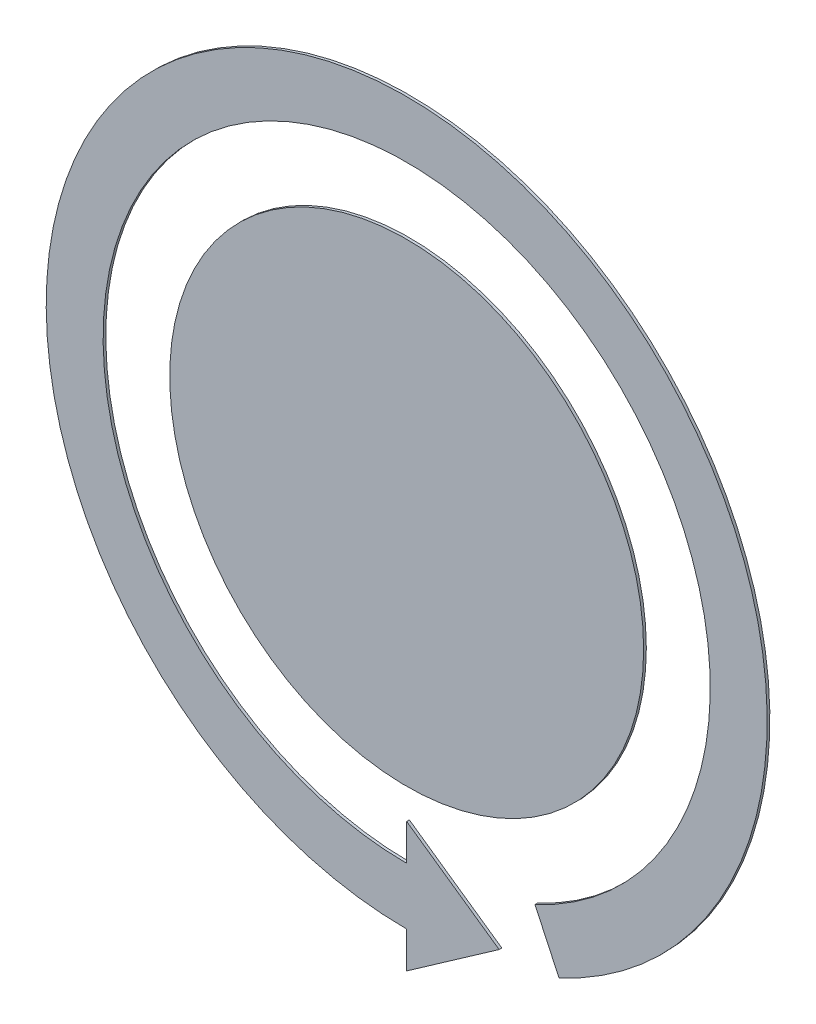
ISO-10303-21;
HEADER;
FILE_DESCRIPTION(('STEP AP214'),'2;1');
FILE_NAME('part.step','',(''),(''),'','','');
FILE_SCHEMA(('AUTOMOTIVE_DESIGN { 1 0 10303 214 1 1 1 1 }'));
ENDSEC;
DATA;
#1=APPLICATION_CONTEXT('core data for automotive mechanical design processes');
#2=APPLICATION_PROTOCOL_DEFINITION('international standard','automotive_design',2000,#1);
#3=PRODUCT_CONTEXT('',#1,'mechanical');
#4=PRODUCT('Part','Part','',(#3));
#5=PRODUCT_RELATED_PRODUCT_CATEGORY('part','',(#4));
#6=PRODUCT_DEFINITION_FORMATION('','',#4);
#7=PRODUCT_DEFINITION_CONTEXT('part definition',#1,'design');
#8=PRODUCT_DEFINITION('design','',#6,#7);
#9=PRODUCT_DEFINITION_SHAPE('','',#8);
#10=(LENGTH_UNIT() NAMED_UNIT(*) SI_UNIT(.MILLI.,.METRE.));
#11=(NAMED_UNIT(*) PLANE_ANGLE_UNIT() SI_UNIT($,.RADIAN.));
#12=(NAMED_UNIT(*) SI_UNIT($,.STERADIAN.) SOLID_ANGLE_UNIT());
#13=UNCERTAINTY_MEASURE_WITH_UNIT(LENGTH_MEASURE(1.E-05),#10,'distance_accuracy_value','');
#14=(GEOMETRIC_REPRESENTATION_CONTEXT(3) GLOBAL_UNCERTAINTY_ASSIGNED_CONTEXT((#13)) GLOBAL_UNIT_ASSIGNED_CONTEXT((#10,
#11,#12)) REPRESENTATION_CONTEXT('',''));
#15=CARTESIAN_POINT('',(0.,0.,0.));
#16=DIRECTION('',(0.,0.,1.));
#17=DIRECTION('',(1.,0.,0.));
#18=AXIS2_PLACEMENT_3D('',#15,#16,#17);
#19=CARTESIAN_POINT('',(0.,0.,3.));
#20=DIRECTION('',(0.,0.,-1.));
#21=DIRECTION('',(-1.,0.,0.));
#22=AXIS2_PLACEMENT_3D('',#19,#20,#21);
#23=CYLINDRICAL_SURFACE('',#22,402.162503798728);
#24=CARTESIAN_POINT('',(0.,0.,0.));
#25=DIRECTION('',(0.,0.,1.));
#26=DIRECTION('',(1.,0.,0.));
#27=AXIS2_PLACEMENT_3D('',#24,#25,#26);
#28=CIRCLE('',#27,402.162503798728);
#29=CARTESIAN_POINT('',(169.961218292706,-364.483008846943,0.));
#30=VERTEX_POINT('',#29);
#31=CARTESIAN_POINT('',(0.,-402.162503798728,0.));
#32=VERTEX_POINT('',#31);
#33=EDGE_CURVE('E133',#30,#32,#28,.T.);
#34=ORIENTED_EDGE('',*,*,#33,.T.);
#35=DIRECTION('',(0.,0.,-1.));
#36=VECTOR('',#35,1.);
#37=CARTESIAN_POINT('',(0.,-402.162503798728,3.));
#38=LINE('',#37,#36);
#39=CARTESIAN_POINT('',(0.,-402.162503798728,3.));
#40=VERTEX_POINT('',#39);
#41=EDGE_CURVE('E12',#40,#32,#38,.T.);
#42=ORIENTED_EDGE('',*,*,#41,.F.);
#43=CARTESIAN_POINT('',(0.,0.,3.));
#44=DIRECTION('',(0.,0.,1.));
#45=DIRECTION('',(1.,0.,0.));
#46=AXIS2_PLACEMENT_3D('',#43,#44,#45);
#47=CIRCLE('',#46,402.162503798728);
#48=CARTESIAN_POINT('',(169.961218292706,-364.483008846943,3.));
#49=VERTEX_POINT('',#48);
#50=EDGE_CURVE('E145',#49,#40,#47,.T.);
#51=ORIENTED_EDGE('',*,*,#50,.F.);
#52=DIRECTION('',(0.,0.,-1.));
#53=VECTOR('',#52,1.);
#54=CARTESIAN_POINT('',(169.961218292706,-364.483008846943,3.));
#55=LINE('',#54,#53);
#56=EDGE_CURVE('E129',#49,#30,#55,.T.);
#57=ORIENTED_EDGE('',*,*,#56,.T.);
#58=EDGE_LOOP('',(#34,#42,#51,#57));
#59=FACE_BOUND('',#58,.T.);
#60=ADVANCED_FACE('F43',(#59),#23,.T.);
#61=CARTESIAN_POINT('',(0.,-442.630507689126,3.));
#62=DIRECTION('',(1.,0.,0.));
#63=DIRECTION('',(0.,0.,-1.));
#64=AXIS2_PLACEMENT_3D('',#61,#62,#63);
#65=PLANE('',#64);
#66=DIRECTION('',(0.,-1.,0.));
#67=VECTOR('',#66,1.);
#68=CARTESIAN_POINT('',(0.,-442.630507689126,0.));
#69=LINE('',#68,#67);
#70=CARTESIAN_POINT('',(0.,-442.630507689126,0.));
#71=VERTEX_POINT('',#70);
#72=EDGE_CURVE('E136',#32,#71,#69,.T.);
#73=ORIENTED_EDGE('',*,*,#72,.T.);
#74=DIRECTION('',(0.,0.,-1.));
#75=VECTOR('',#74,1.);
#76=CARTESIAN_POINT('',(0.,-442.630507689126,3.));
#77=LINE('',#76,#75);
#78=CARTESIAN_POINT('',(0.,-442.630507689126,3.));
#79=VERTEX_POINT('',#78);
#80=EDGE_CURVE('E51',#79,#71,#77,.T.);
#81=ORIENTED_EDGE('',*,*,#80,.F.);
#82=DIRECTION('',(0.,-1.,0.));
#83=VECTOR('',#82,1.);
#84=CARTESIAN_POINT('',(0.,-442.630507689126,3.));
#85=LINE('',#84,#83);
#86=EDGE_CURVE('E99',#40,#79,#85,.T.);
#87=ORIENTED_EDGE('',*,*,#86,.F.);
#88=ORIENTED_EDGE('',*,*,#41,.T.);
#89=EDGE_LOOP('',(#73,#81,#87,#88));
#90=FACE_BOUND('',#89,.T.);
#91=ADVANCED_FACE('F170',(#90),#65,.F.);
#92=CARTESIAN_POINT('',(103.132265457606,-370.416663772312,3.));
#93=DIRECTION('',(-0.573575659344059,0.819152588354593,0.));
#94=DIRECTION('',(-0.819152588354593,-0.573575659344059,0.));
#95=AXIS2_PLACEMENT_3D('',#92,#93,#94);
#96=PLANE('',#95);
#97=DIRECTION('',(0.819152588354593,0.573575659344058,0.));
#98=VECTOR('',#97,1.);
#99=CARTESIAN_POINT('',(103.132265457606,-370.416663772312,0.));
#100=LINE('',#99,#98);
#101=CARTESIAN_POINT('',(103.132265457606,-370.416663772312,0.));
#102=VERTEX_POINT('',#101);
#103=EDGE_CURVE('E138',#71,#102,#100,.T.);
#104=ORIENTED_EDGE('',*,*,#103,.T.);
#105=DIRECTION('',(0.,0.,-1.));
#106=VECTOR('',#105,1.);
#107=CARTESIAN_POINT('',(103.132265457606,-370.416663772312,3.));
#108=LINE('',#107,#106);
#109=CARTESIAN_POINT('',(103.132265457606,-370.416663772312,3.));
#110=VERTEX_POINT('',#109);
#111=EDGE_CURVE('E149',#110,#102,#108,.T.);
#112=ORIENTED_EDGE('',*,*,#111,.F.);
#113=DIRECTION('',(0.819152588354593,0.573575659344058,0.));
#114=VECTOR('',#113,1.);
#115=CARTESIAN_POINT('',(103.132265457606,-370.416663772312,3.));
#116=LINE('',#115,#114);
#117=EDGE_CURVE('E157',#79,#110,#116,.T.);
#118=ORIENTED_EDGE('',*,*,#117,.F.);
#119=ORIENTED_EDGE('',*,*,#80,.T.);
#120=EDGE_LOOP('',(#104,#112,#118,#119));
#121=FACE_BOUND('',#120,.T.);
#122=ADVANCED_FACE('F155',(#121),#96,.F.);
#123=CARTESIAN_POINT('',(0.,-298.202571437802,3.));
#124=DIRECTION('',(-0.573576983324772,-0.819151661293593,0.));
#125=DIRECTION('',(0.819151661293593,-0.573576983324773,0.));
#126=AXIS2_PLACEMENT_3D('',#123,#124,#125);
#127=PLANE('',#126);
#128=DIRECTION('',(-0.819151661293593,0.573576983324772,0.));
#129=VECTOR('',#128,1.);
#130=CARTESIAN_POINT('',(0.,-298.202571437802,0.));
#131=LINE('',#130,#129);
#132=CARTESIAN_POINT('',(0.,-298.202571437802,0.));
#133=VERTEX_POINT('',#132);
#134=EDGE_CURVE('E140',#102,#133,#131,.T.);
#135=ORIENTED_EDGE('',*,*,#134,.T.);
#136=DIRECTION('',(0.,0.,-1.));
#137=VECTOR('',#136,1.);
#138=CARTESIAN_POINT('',(0.,-298.202571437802,3.));
#139=LINE('',#138,#137);
#140=CARTESIAN_POINT('',(0.,-298.202571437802,3.));
#141=VERTEX_POINT('',#140);
#142=EDGE_CURVE('E124',#141,#133,#139,.T.);
#143=ORIENTED_EDGE('',*,*,#142,.F.);
#144=DIRECTION('',(-0.819151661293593,0.573576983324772,0.));
#145=VECTOR('',#144,1.);
#146=CARTESIAN_POINT('',(0.,-298.202571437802,3.));
#147=LINE('',#146,#145);
#148=EDGE_CURVE('E115',#110,#141,#147,.T.);
#149=ORIENTED_EDGE('',*,*,#148,.F.);
#150=ORIENTED_EDGE('',*,*,#111,.T.);
#151=EDGE_LOOP('',(#135,#143,#149,#150));
#152=FACE_BOUND('',#151,.T.);
#153=ADVANCED_FACE('F163',(#152),#127,.F.);
#154=CARTESIAN_POINT('',(0.,-338.6705753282,3.));
#155=DIRECTION('',(1.,0.,0.));
#156=DIRECTION('',(0.,0.,-1.));
#157=AXIS2_PLACEMENT_3D('',#154,#155,#156);
#158=PLANE('',#157);
#159=DIRECTION('',(0.,-1.,0.));
#160=VECTOR('',#159,1.);
#161=CARTESIAN_POINT('',(0.,-338.6705753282,0.));
#162=LINE('',#161,#160);
#163=CARTESIAN_POINT('',(0.,-338.6705753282,0.));
#164=VERTEX_POINT('',#163);
#165=EDGE_CURVE('E123',#133,#164,#162,.T.);
#166=ORIENTED_EDGE('',*,*,#165,.T.);
#167=DIRECTION('',(0.,0.,-1.));
#168=VECTOR('',#167,1.);
#169=CARTESIAN_POINT('',(0.,-338.6705753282,3.));
#170=LINE('',#169,#168);
#171=CARTESIAN_POINT('',(0.,-338.6705753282,3.));
#172=VERTEX_POINT('',#171);
#173=EDGE_CURVE('E120',#172,#164,#170,.T.);
#174=ORIENTED_EDGE('',*,*,#173,.F.);
#175=DIRECTION('',(0.,-1.,0.));
#176=VECTOR('',#175,1.);
#177=CARTESIAN_POINT('',(0.,-338.6705753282,3.));
#178=LINE('',#177,#176);
#179=EDGE_CURVE('E109',#141,#172,#178,.T.);
#180=ORIENTED_EDGE('',*,*,#179,.F.);
#181=ORIENTED_EDGE('',*,*,#142,.T.);
#182=EDGE_LOOP('',(#166,#174,#180,#181));
#183=FACE_BOUND('',#182,.T.);
#184=ADVANCED_FACE('F121',(#183),#158,.F.);
#185=CARTESIAN_POINT('',(0.,0.,3.));
#186=DIRECTION('',(0.,0.,-1.));
#187=DIRECTION('',(-1.,0.,0.));
#188=AXIS2_PLACEMENT_3D('',#185,#186,#187);
#189=CYLINDRICAL_SURFACE('',#188,338.6705753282);
#190=CARTESIAN_POINT('',(0.,0.,0.));
#191=DIRECTION('',(0.,0.,-1.));
#192=DIRECTION('',(1.,0.,0.));
#193=AXIS2_PLACEMENT_3D('',#190,#191,#192);
#194=CIRCLE('',#193,338.6705753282);
#195=CARTESIAN_POINT('',(143.128369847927,-306.93977966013,0.));
#196=VERTEX_POINT('',#195);
#197=EDGE_CURVE('E85',#164,#196,#194,.T.);
#198=ORIENTED_EDGE('',*,*,#197,.T.);
#199=DIRECTION('',(0.,0.,-1.));
#200=VECTOR('',#199,1.);
#201=CARTESIAN_POINT('',(143.128369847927,-306.93977966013,3.));
#202=LINE('',#201,#200);
#203=CARTESIAN_POINT('',(143.128369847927,-306.93977966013,3.));
#204=VERTEX_POINT('',#203);
#205=EDGE_CURVE('E125',#204,#196,#202,.T.);
#206=ORIENTED_EDGE('',*,*,#205,.F.);
#207=CARTESIAN_POINT('',(0.,0.,3.));
#208=DIRECTION('',(0.,0.,-1.));
#209=DIRECTION('',(1.,0.,0.));
#210=AXIS2_PLACEMENT_3D('',#207,#208,#209);
#211=CIRCLE('',#210,338.6705753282);
#212=EDGE_CURVE('E113',#172,#204,#211,.T.);
#213=ORIENTED_EDGE('',*,*,#212,.F.);
#214=ORIENTED_EDGE('',*,*,#173,.T.);
#215=EDGE_LOOP('',(#198,#206,#213,#214));
#216=FACE_BOUND('',#215,.T.);
#217=ADVANCED_FACE('F127',(#216),#189,.F.);
#218=CARTESIAN_POINT('',(169.961218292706,-364.483008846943,3.));
#219=DIRECTION('',(0.906307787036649,0.422618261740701,0.));
#220=DIRECTION('',(-0.422618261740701,0.906307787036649,0.));
#221=AXIS2_PLACEMENT_3D('',#218,#219,#220);
#222=PLANE('',#221);
#223=DIRECTION('',(0.422618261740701,-0.906307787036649,0.));
#224=VECTOR('',#223,1.);
#225=CARTESIAN_POINT('',(169.961218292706,-364.483008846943,0.));
#226=LINE('',#225,#224);
#227=EDGE_CURVE('E91',#196,#30,#226,.T.);
#228=ORIENTED_EDGE('',*,*,#227,.T.);
#229=ORIENTED_EDGE('',*,*,#56,.F.);
#230=DIRECTION('',(0.422618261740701,-0.906307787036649,0.));
#231=VECTOR('',#230,1.);
#232=CARTESIAN_POINT('',(169.961218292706,-364.483008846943,3.));
#233=LINE('',#232,#231);
#234=EDGE_CURVE('E59',#204,#49,#233,.T.);
#235=ORIENTED_EDGE('',*,*,#234,.F.);
#236=ORIENTED_EDGE('',*,*,#205,.T.);
#237=EDGE_LOOP('',(#228,#229,#235,#236));
#238=FACE_BOUND('',#237,.T.);
#239=ADVANCED_FACE('F184',(#238),#222,.F.);
#240=CARTESIAN_POINT('',(0.,0.,3.));
#241=DIRECTION('',(0.,0.,1.));
#242=DIRECTION('',(1.,0.,0.));
#243=AXIS2_PLACEMENT_3D('',#240,#241,#242);
#244=PLANE('',#243);
#245=ORIENTED_EDGE('',*,*,#50,.T.);
#246=ORIENTED_EDGE('',*,*,#86,.T.);
#247=ORIENTED_EDGE('',*,*,#117,.T.);
#248=ORIENTED_EDGE('',*,*,#148,.T.);
#249=ORIENTED_EDGE('',*,*,#179,.T.);
#250=ORIENTED_EDGE('',*,*,#212,.T.);
#251=ORIENTED_EDGE('',*,*,#234,.T.);
#252=EDGE_LOOP('',(#245,#246,#247,#248,#249,#250,#251));
#253=FACE_BOUND('',#252,.T.);
#254=ADVANCED_FACE('F111',(#253),#244,.T.);
#255=CARTESIAN_POINT('',(0.,0.,0.));
#256=DIRECTION('',(0.,0.,1.));
#257=DIRECTION('',(1.,0.,0.));
#258=AXIS2_PLACEMENT_3D('',#255,#256,#257);
#259=PLANE('',#258);
#260=ORIENTED_EDGE('',*,*,#33,.F.);
#261=ORIENTED_EDGE('',*,*,#227,.F.);
#262=ORIENTED_EDGE('',*,*,#197,.F.);
#263=ORIENTED_EDGE('',*,*,#165,.F.);
#264=ORIENTED_EDGE('',*,*,#134,.F.);
#265=ORIENTED_EDGE('',*,*,#103,.F.);
#266=ORIENTED_EDGE('',*,*,#72,.F.);
#267=EDGE_LOOP('',(#260,#261,#262,#263,#264,#265,#266));
#268=FACE_BOUND('',#267,.T.);
#269=ADVANCED_FACE('F161',(#268),#259,.F.);
#270=CLOSED_SHELL('',(#60,#91,#122,#153,#184,#217,#239,#254,#269));
#271=MANIFOLD_SOLID_BREP('B2',#270);
#272=CARTESIAN_POINT('',(0.,0.,3.));
#273=DIRECTION('',(0.,0.,-1.));
#274=DIRECTION('',(-1.,0.,0.));
#275=AXIS2_PLACEMENT_3D('',#272,#273,#274);
#276=CYLINDRICAL_SURFACE('',#275,264.349234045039);
#277=CARTESIAN_POINT('',(0.,0.,3.));
#278=DIRECTION('',(0.,0.,1.));
#279=DIRECTION('',(1.,0.,0.));
#280=AXIS2_PLACEMENT_3D('',#277,#278,#279);
#281=CIRCLE('',#280,264.349234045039);
#282=CARTESIAN_POINT('',(264.349234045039,0.,3.));
#283=VERTEX_POINT('',#282);
#284=EDGE_CURVE('E42',#283,#283,#281,.T.);
#285=ORIENTED_EDGE('',*,*,#284,.F.);
#286=EDGE_LOOP('',(#285));
#287=FACE_BOUND('',#286,.T.);
#288=CARTESIAN_POINT('',(0.,0.,0.));
#289=DIRECTION('',(0.,0.,1.));
#290=DIRECTION('',(1.,0.,0.));
#291=AXIS2_PLACEMENT_3D('',#288,#289,#290);
#292=CIRCLE('',#291,264.349234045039);
#293=CARTESIAN_POINT('',(264.349234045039,0.,0.));
#294=VERTEX_POINT('',#293);
#295=EDGE_CURVE('E248',#294,#294,#292,.T.);
#296=ORIENTED_EDGE('',*,*,#295,.T.);
#297=EDGE_LOOP('',(#296));
#298=FACE_BOUND('',#297,.T.);
#299=ADVANCED_FACE('F245',(#287,#298),#276,.T.);
#300=CARTESIAN_POINT('',(0.,0.,3.));
#301=DIRECTION('',(0.,0.,1.));
#302=DIRECTION('',(1.,0.,0.));
#303=AXIS2_PLACEMENT_3D('',#300,#301,#302);
#304=PLANE('',#303);
#305=ORIENTED_EDGE('',*,*,#284,.T.);
#306=EDGE_LOOP('',(#305));
#307=FACE_BOUND('',#306,.T.);
#308=ADVANCED_FACE('F260',(#307),#304,.T.);
#309=CARTESIAN_POINT('',(0.,0.,0.));
#310=DIRECTION('',(0.,0.,1.));
#311=DIRECTION('',(1.,0.,0.));
#312=AXIS2_PLACEMENT_3D('',#309,#310,#311);
#313=PLANE('',#312);
#314=ORIENTED_EDGE('',*,*,#295,.F.);
#315=EDGE_LOOP('',(#314));
#316=FACE_BOUND('',#315,.T.);
#317=ADVANCED_FACE('F258',(#316),#313,.F.);
#318=CLOSED_SHELL('',(#299,#308,#317));
#319=MANIFOLD_SOLID_BREP('B6',#318);
#320=ADVANCED_BREP_SHAPE_REPRESENTATION('',(#18,#271,#319),#14);
#321=SHAPE_DEFINITION_REPRESENTATION(#9,#320);
ENDSEC;
END-ISO-10303-21;
